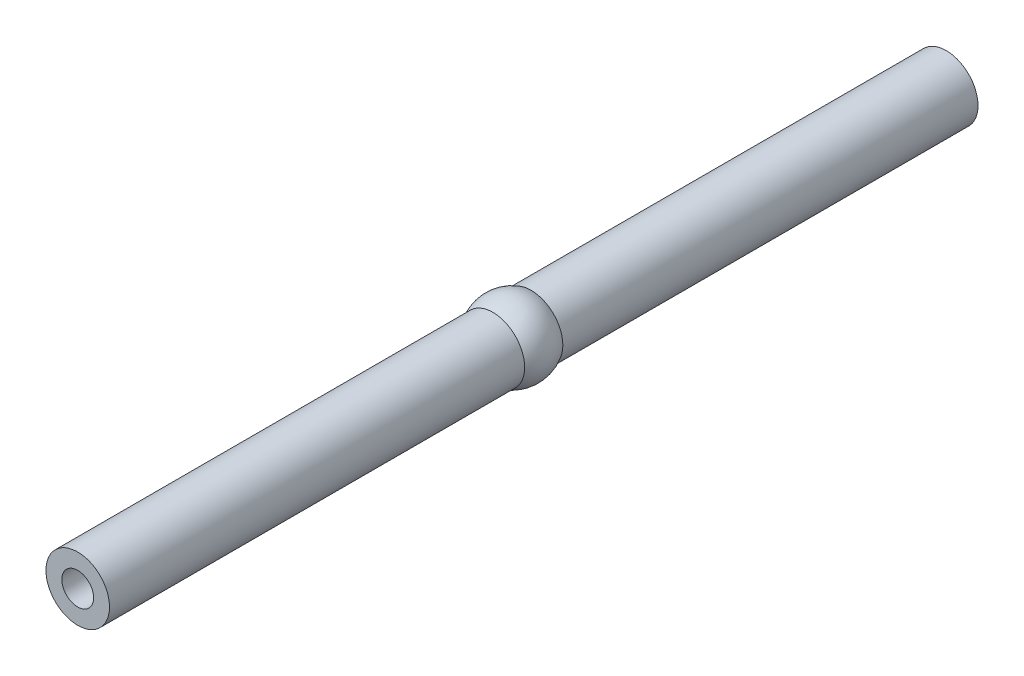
from build123d import *

# Parameters (mm, degrees)
ESQUISSE1_R             = 3
EXTRUSION1_DEPTH        = 41
ESQUISSE2_R             = 1.5
ENL_V_MAT_EXTRU_1_DEPTH = 10


with BuildPart() as part:
    # Esquisse1 → Extrusion1 (new, symmetric)
    with BuildSketch(Plane.XY):
        Circle(ESQUISSE1_R)
    extrude(amount=EXTRUSION1_DEPTH, both=True)

    # Esquisse2 → Enl_v. mat.-Extru.1 (cut)
    with BuildSketch(Plane.XY.offset(41)):
        Circle(ESQUISSE2_R)
    enl_v_mat_extru_1 = extrude(amount=-ENL_V_MAT_EXTRU_1_DEPTH, mode=Mode.SUBTRACT)

    # Sym_trie1: Enl_v. mat.-Extru.1 across plane
    add(enl_v_mat_extru_1.mirror(Plane.XY), mode=Mode.SUBTRACT)

    # Esquisse3 → R_volution1 (revolve)
    with BuildSketch(Plane(origin=(0, 0, 0), x_dir=(1, 0, 0), z_dir=(0, 1, 0))):
        with BuildLine():
            Line((0, -3.5), (0, 3.5))
            ThreePointArc((0, 3.5), (-3.5, 0), (0, -3.5))
        make_face()
    revolve(axis=Axis((0, 0, -20.452007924), (0, 0, 1)))


solid = part.part
